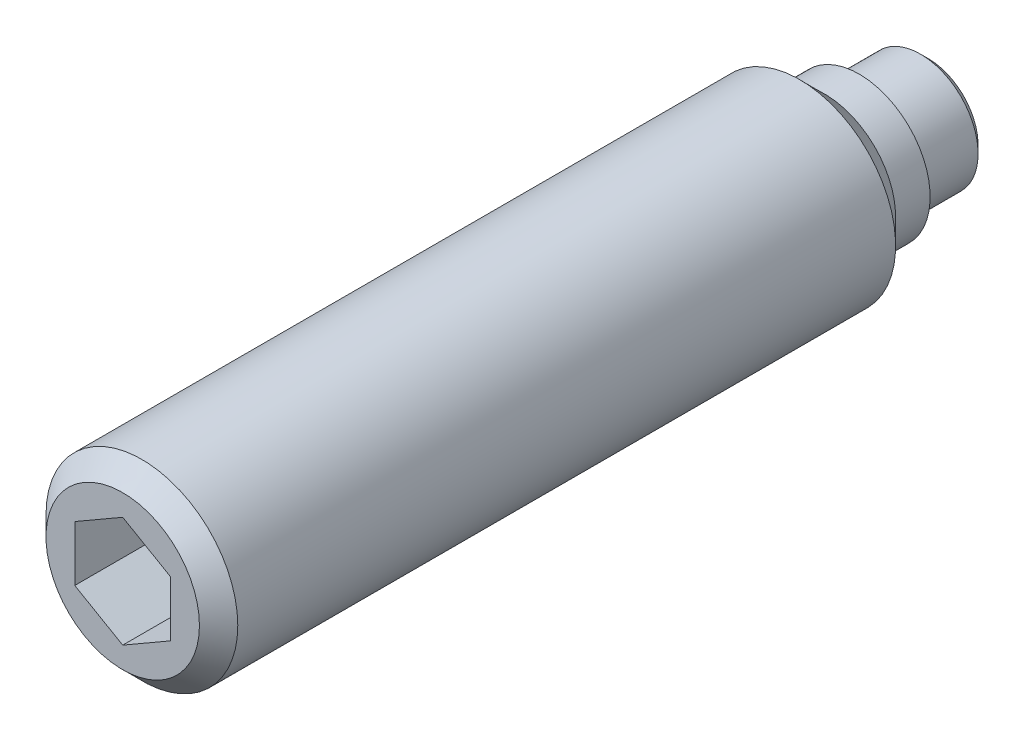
ISO-10303-21;
HEADER;
FILE_DESCRIPTION(('STEP AP214'),'2;1');
FILE_NAME('part.step','',(''),(''),'','','');
FILE_SCHEMA(('AUTOMOTIVE_DESIGN { 1 0 10303 214 1 1 1 1 }'));
ENDSEC;
DATA;
#1=APPLICATION_CONTEXT('core data for automotive mechanical design processes');
#2=APPLICATION_PROTOCOL_DEFINITION('international standard','automotive_design',2000,#1);
#3=PRODUCT_CONTEXT('',#1,'mechanical');
#4=PRODUCT('Part','Part','',(#3));
#5=PRODUCT_RELATED_PRODUCT_CATEGORY('part','',(#4));
#6=PRODUCT_DEFINITION_FORMATION('','',#4);
#7=PRODUCT_DEFINITION_CONTEXT('part definition',#1,'design');
#8=PRODUCT_DEFINITION('design','',#6,#7);
#9=PRODUCT_DEFINITION_SHAPE('','',#8);
#10=(LENGTH_UNIT() NAMED_UNIT(*) SI_UNIT(.MILLI.,.METRE.));
#11=(NAMED_UNIT(*) PLANE_ANGLE_UNIT() SI_UNIT($,.RADIAN.));
#12=(NAMED_UNIT(*) SI_UNIT($,.STERADIAN.) SOLID_ANGLE_UNIT());
#13=UNCERTAINTY_MEASURE_WITH_UNIT(LENGTH_MEASURE(1.E-05),#10,'distance_accuracy_value','');
#14=(GEOMETRIC_REPRESENTATION_CONTEXT(3) GLOBAL_UNCERTAINTY_ASSIGNED_CONTEXT((#13)) GLOBAL_UNIT_ASSIGNED_CONTEXT((#10,
#11,#12)) REPRESENTATION_CONTEXT('',''));
#15=CARTESIAN_POINT('',(0.,0.,0.));
#16=DIRECTION('',(0.,0.,1.));
#17=DIRECTION('',(1.,0.,0.));
#18=AXIS2_PLACEMENT_3D('',#15,#16,#17);
#19=CARTESIAN_POINT('',(0.,0.,1.8));
#20=DIRECTION('',(0.,0.,-1.));
#21=DIRECTION('',(-1.,0.,0.));
#22=AXIS2_PLACEMENT_3D('',#19,#20,#21);
#23=CYLINDRICAL_SURFACE('',#22,2.5);
#24=CARTESIAN_POINT('',(0.,0.,3.35));
#25=DIRECTION('',(0.,0.,-1.));
#26=DIRECTION('',(-1.,0.,0.));
#27=AXIS2_PLACEMENT_3D('',#24,#25,#26);
#28=CIRCLE('',#27,2.5);
#29=CARTESIAN_POINT('',(-2.5,0.,3.35));
#30=VERTEX_POINT('',#29);
#31=EDGE_CURVE('E9',#30,#30,#28,.T.);
#32=ORIENTED_EDGE('',*,*,#31,.F.);
#33=EDGE_LOOP('',(#32));
#34=FACE_BOUND('',#33,.T.);
#35=CARTESIAN_POINT('',(0.,0.,20.5));
#36=DIRECTION('',(0.,0.,1.));
#37=DIRECTION('',(1.,0.,0.));
#38=AXIS2_PLACEMENT_3D('',#35,#36,#37);
#39=CIRCLE('',#38,2.5);
#40=CARTESIAN_POINT('',(2.5,0.,20.5));
#41=VERTEX_POINT('',#40);
#42=EDGE_CURVE('E123',#41,#41,#39,.T.);
#43=ORIENTED_EDGE('',*,*,#42,.F.);
#44=EDGE_LOOP('',(#43));
#45=FACE_BOUND('',#44,.T.);
#46=ADVANCED_FACE('F14',(#34,#45),#23,.T.);
#47=CARTESIAN_POINT('',(0.,0.,3.35));
#48=DIRECTION('',(0.,0.,1.));
#49=DIRECTION('',(1.,0.,0.));
#50=AXIS2_PLACEMENT_3D('',#47,#48,#49);
#51=CONICAL_SURFACE('',#50,2.5,0.785398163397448);
#52=ORIENTED_EDGE('',*,*,#31,.T.);
#53=EDGE_LOOP('',(#52));
#54=FACE_BOUND('',#53,.T.);
#55=CARTESIAN_POINT('',(0.,0.,2.7));
#56=DIRECTION('',(0.,0.,-1.));
#57=DIRECTION('',(-1.,0.,0.));
#58=AXIS2_PLACEMENT_3D('',#55,#56,#57);
#59=CIRCLE('',#58,1.85);
#60=CARTESIAN_POINT('',(-1.85,0.,2.7));
#61=VERTEX_POINT('',#60);
#62=EDGE_CURVE('E21',#61,#61,#59,.T.);
#63=ORIENTED_EDGE('',*,*,#62,.F.);
#64=EDGE_LOOP('',(#63));
#65=FACE_BOUND('',#64,.T.);
#66=ADVANCED_FACE('F143',(#54,#65),#51,.T.);
#67=CARTESIAN_POINT('',(0.,0.,1.8));
#68=DIRECTION('',(0.,0.,-1.));
#69=DIRECTION('',(-1.,0.,0.));
#70=AXIS2_PLACEMENT_3D('',#67,#68,#69);
#71=CYLINDRICAL_SURFACE('',#70,1.85);
#72=ORIENTED_EDGE('',*,*,#62,.T.);
#73=EDGE_LOOP('',(#72));
#74=FACE_BOUND('',#73,.T.);
#75=CARTESIAN_POINT('',(0.,0.,1.8));
#76=DIRECTION('',(0.,0.,-1.));
#77=DIRECTION('',(-1.,0.,0.));
#78=AXIS2_PLACEMENT_3D('',#75,#76,#77);
#79=CIRCLE('',#78,1.85);
#80=CARTESIAN_POINT('',(-1.85,0.,1.8));
#81=VERTEX_POINT('',#80);
#82=EDGE_CURVE('E135',#81,#81,#79,.T.);
#83=ORIENTED_EDGE('',*,*,#82,.F.);
#84=EDGE_LOOP('',(#83));
#85=FACE_BOUND('',#84,.T.);
#86=ADVANCED_FACE('F140',(#74,#85),#71,.T.);
#87=CARTESIAN_POINT('',(0.,1.85,1.8));
#88=DIRECTION('',(0.,0.,1.));
#89=DIRECTION('',(1.,0.,0.));
#90=AXIS2_PLACEMENT_3D('',#87,#88,#89);
#91=PLANE('',#90);
#92=ORIENTED_EDGE('',*,*,#82,.T.);
#93=EDGE_LOOP('',(#92));
#94=FACE_BOUND('',#93,.T.);
#95=CARTESIAN_POINT('',(0.,0.,1.8));
#96=DIRECTION('',(0.,0.,-1.));
#97=DIRECTION('',(-1.,0.,0.));
#98=AXIS2_PLACEMENT_3D('',#95,#96,#97);
#99=CIRCLE('',#98,1.5);
#100=CARTESIAN_POINT('',(-1.5,0.,1.8));
#101=VERTEX_POINT('',#100);
#102=EDGE_CURVE('E132',#101,#101,#99,.T.);
#103=ORIENTED_EDGE('',*,*,#102,.F.);
#104=EDGE_LOOP('',(#103));
#105=FACE_BOUND('',#104,.T.);
#106=ADVANCED_FACE('F151',(#94,#105),#91,.F.);
#107=CARTESIAN_POINT('',(0.,0.,0.));
#108=DIRECTION('',(0.,0.,-1.));
#109=DIRECTION('',(-1.,0.,0.));
#110=AXIS2_PLACEMENT_3D('',#107,#108,#109);
#111=CYLINDRICAL_SURFACE('',#110,1.5);
#112=CARTESIAN_POINT('',(0.,0.,0.2));
#113=DIRECTION('',(0.,0.,-1.));
#114=DIRECTION('',(-1.,0.,0.));
#115=AXIS2_PLACEMENT_3D('',#112,#113,#114);
#116=CIRCLE('',#115,1.5);
#117=CARTESIAN_POINT('',(-1.5,0.,0.2));
#118=VERTEX_POINT('',#117);
#119=EDGE_CURVE('E129',#118,#118,#116,.T.);
#120=ORIENTED_EDGE('',*,*,#119,.F.);
#121=EDGE_LOOP('',(#120));
#122=FACE_BOUND('',#121,.T.);
#123=ORIENTED_EDGE('',*,*,#102,.T.);
#124=EDGE_LOOP('',(#123));
#125=FACE_BOUND('',#124,.T.);
#126=ADVANCED_FACE('F157',(#122,#125),#111,.T.);
#127=CARTESIAN_POINT('',(0.,0.,0.2));
#128=DIRECTION('',(0.,0.,1.));
#129=DIRECTION('',(1.,0.,0.));
#130=AXIS2_PLACEMENT_3D('',#127,#128,#129);
#131=CONICAL_SURFACE('',#130,1.5,0.785398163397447);
#132=CARTESIAN_POINT('',(0.,0.,0.));
#133=DIRECTION('',(0.,0.,-1.));
#134=DIRECTION('',(-1.,0.,0.));
#135=AXIS2_PLACEMENT_3D('',#132,#133,#134);
#136=CIRCLE('',#135,1.3);
#137=CARTESIAN_POINT('',(-1.3,0.,0.));
#138=VERTEX_POINT('',#137);
#139=EDGE_CURVE('E126',#138,#138,#136,.T.);
#140=ORIENTED_EDGE('',*,*,#139,.F.);
#141=EDGE_LOOP('',(#140));
#142=FACE_BOUND('',#141,.T.);
#143=ORIENTED_EDGE('',*,*,#119,.T.);
#144=EDGE_LOOP('',(#143));
#145=FACE_BOUND('',#144,.T.);
#146=ADVANCED_FACE('F161',(#142,#145),#131,.T.);
#147=CARTESIAN_POINT('',(0.,1.3,0.));
#148=DIRECTION('',(0.,0.,1.));
#149=DIRECTION('',(1.,0.,0.));
#150=AXIS2_PLACEMENT_3D('',#147,#148,#149);
#151=PLANE('',#150);
#152=ORIENTED_EDGE('',*,*,#139,.T.);
#153=EDGE_LOOP('',(#152));
#154=FACE_BOUND('',#153,.T.);
#155=ADVANCED_FACE('F165',(#154),#151,.F.);
#156=CARTESIAN_POINT('',(0.,0.,21.));
#157=DIRECTION('',(0.,0.,-1.));
#158=DIRECTION('',(-1.,0.,0.));
#159=AXIS2_PLACEMENT_3D('',#156,#157,#158);
#160=CONICAL_SURFACE('',#159,2.,0.785398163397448);
#161=ORIENTED_EDGE('',*,*,#42,.T.);
#162=EDGE_LOOP('',(#161));
#163=FACE_BOUND('',#162,.T.);
#164=CARTESIAN_POINT('',(0.,0.,21.));
#165=DIRECTION('',(0.,0.,1.));
#166=DIRECTION('',(1.,0.,0.));
#167=AXIS2_PLACEMENT_3D('',#164,#165,#166);
#168=CIRCLE('',#167,2.);
#169=CARTESIAN_POINT('',(2.,0.,21.));
#170=VERTEX_POINT('',#169);
#171=EDGE_CURVE('E115',#170,#170,#168,.T.);
#172=ORIENTED_EDGE('',*,*,#171,.F.);
#173=EDGE_LOOP('',(#172));
#174=FACE_BOUND('',#173,.T.);
#175=ADVANCED_FACE('F169',(#163,#174),#160,.T.);
#176=CARTESIAN_POINT('',(0.,-2.,21.));
#177=DIRECTION('',(0.,0.,1.));
#178=DIRECTION('',(1.,0.,0.));
#179=AXIS2_PLACEMENT_3D('',#176,#177,#178);
#180=PLANE('',#179);
#181=DIRECTION('',(0.866025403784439,-0.5,0.));
#182=VECTOR('',#181,1.);
#183=CARTESIAN_POINT('',(-1.25,-0.721687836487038,21.));
#184=LINE('',#183,#182);
#185=CARTESIAN_POINT('',(-1.25,-0.721687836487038,21.));
#186=VERTEX_POINT('',#185);
#187=CARTESIAN_POINT('',(0.,-1.44337567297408,21.));
#188=VERTEX_POINT('',#187);
#189=EDGE_CURVE('E28',#186,#188,#184,.T.);
#190=ORIENTED_EDGE('',*,*,#189,.F.);
#191=DIRECTION('',(0.,-1.,0.));
#192=VECTOR('',#191,1.);
#193=CARTESIAN_POINT('',(-1.25,0.721687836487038,21.));
#194=LINE('',#193,#192);
#195=CARTESIAN_POINT('',(-1.25,0.721687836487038,21.));
#196=VERTEX_POINT('',#195);
#197=EDGE_CURVE('E111',#196,#186,#194,.T.);
#198=ORIENTED_EDGE('',*,*,#197,.F.);
#199=DIRECTION('',(-0.866025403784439,-0.5,0.));
#200=VECTOR('',#199,1.);
#201=CARTESIAN_POINT('',(0.,1.44337567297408,21.));
#202=LINE('',#201,#200);
#203=CARTESIAN_POINT('',(0.,1.44337567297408,21.));
#204=VERTEX_POINT('',#203);
#205=EDGE_CURVE('E109',#204,#196,#202,.T.);
#206=ORIENTED_EDGE('',*,*,#205,.F.);
#207=DIRECTION('',(-0.866025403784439,0.5,0.));
#208=VECTOR('',#207,1.);
#209=CARTESIAN_POINT('',(1.25,0.721687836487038,21.));
#210=LINE('',#209,#208);
#211=CARTESIAN_POINT('',(1.25,0.721687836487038,21.));
#212=VERTEX_POINT('',#211);
#213=EDGE_CURVE('E76',#212,#204,#210,.T.);
#214=ORIENTED_EDGE('',*,*,#213,.F.);
#215=DIRECTION('',(0.,1.,0.));
#216=VECTOR('',#215,1.);
#217=CARTESIAN_POINT('',(1.25,-0.721687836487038,21.));
#218=LINE('',#217,#216);
#219=CARTESIAN_POINT('',(1.25,-0.721687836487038,21.));
#220=VERTEX_POINT('',#219);
#221=EDGE_CURVE('E105',#220,#212,#218,.T.);
#222=ORIENTED_EDGE('',*,*,#221,.F.);
#223=DIRECTION('',(0.866025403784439,0.5,0.));
#224=VECTOR('',#223,1.);
#225=CARTESIAN_POINT('',(0.,-1.44337567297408,21.));
#226=LINE('',#225,#224);
#227=EDGE_CURVE('E102',#188,#220,#226,.T.);
#228=ORIENTED_EDGE('',*,*,#227,.F.);
#229=EDGE_LOOP('',(#190,#198,#206,#214,#222,#228));
#230=FACE_BOUND('',#229,.T.);
#231=ORIENTED_EDGE('',*,*,#171,.T.);
#232=EDGE_LOOP('',(#231));
#233=FACE_BOUND('',#232,.T.);
#234=ADVANCED_FACE('F173',(#230,#233),#180,.T.);
#235=CARTESIAN_POINT('',(-1.25,-0.721687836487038,18.));
#236=DIRECTION('',(-0.5,-0.866025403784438,0.));
#237=DIRECTION('',(0.866025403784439,-0.5,0.));
#238=AXIS2_PLACEMENT_3D('',#235,#236,#237);
#239=PLANE('',#238);
#240=ORIENTED_EDGE('',*,*,#189,.T.);
#241=DIRECTION('',(0.,0.,1.));
#242=VECTOR('',#241,1.);
#243=CARTESIAN_POINT('',(0.,-1.44337567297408,18.));
#244=LINE('',#243,#242);
#245=CARTESIAN_POINT('',(0.,-1.44337567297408,18.));
#246=VERTEX_POINT('',#245);
#247=EDGE_CURVE('E58',#246,#188,#244,.T.);
#248=ORIENTED_EDGE('',*,*,#247,.F.);
#249=DIRECTION('',(0.866025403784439,-0.5,0.));
#250=VECTOR('',#249,1.);
#251=CARTESIAN_POINT('',(-1.25,-0.721687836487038,18.));
#252=LINE('',#251,#250);
#253=CARTESIAN_POINT('',(-1.25,-0.721687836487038,18.));
#254=VERTEX_POINT('',#253);
#255=EDGE_CURVE('E113',#254,#246,#252,.T.);
#256=ORIENTED_EDGE('',*,*,#255,.F.);
#257=DIRECTION('',(0.,0.,1.));
#258=VECTOR('',#257,1.);
#259=CARTESIAN_POINT('',(-1.25,-0.721687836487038,18.));
#260=LINE('',#259,#258);
#261=EDGE_CURVE('E36',#254,#186,#260,.T.);
#262=ORIENTED_EDGE('',*,*,#261,.T.);
#263=EDGE_LOOP('',(#240,#248,#256,#262));
#264=FACE_BOUND('',#263,.T.);
#265=ADVANCED_FACE('F177',(#264),#239,.F.);
#266=CARTESIAN_POINT('',(-1.25,0.721687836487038,18.));
#267=DIRECTION('',(-1.,0.,0.));
#268=DIRECTION('',(0.,0.,1.));
#269=AXIS2_PLACEMENT_3D('',#266,#267,#268);
#270=PLANE('',#269);
#271=ORIENTED_EDGE('',*,*,#197,.T.);
#272=ORIENTED_EDGE('',*,*,#261,.F.);
#273=DIRECTION('',(0.,-1.,0.));
#274=VECTOR('',#273,1.);
#275=CARTESIAN_POINT('',(-1.25,0.721687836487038,18.));
#276=LINE('',#275,#274);
#277=CARTESIAN_POINT('',(-1.25,0.721687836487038,18.));
#278=VERTEX_POINT('',#277);
#279=EDGE_CURVE('E88',#278,#254,#276,.T.);
#280=ORIENTED_EDGE('',*,*,#279,.F.);
#281=DIRECTION('',(0.,0.,1.));
#282=VECTOR('',#281,1.);
#283=CARTESIAN_POINT('',(-1.25,0.721687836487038,18.));
#284=LINE('',#283,#282);
#285=EDGE_CURVE('E80',#278,#196,#284,.T.);
#286=ORIENTED_EDGE('',*,*,#285,.T.);
#287=EDGE_LOOP('',(#271,#272,#280,#286));
#288=FACE_BOUND('',#287,.T.);
#289=ADVANCED_FACE('F181',(#288),#270,.F.);
#290=CARTESIAN_POINT('',(0.,1.44337567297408,18.));
#291=DIRECTION('',(-0.5,0.866025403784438,0.));
#292=DIRECTION('',(-0.866025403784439,-0.5,0.));
#293=AXIS2_PLACEMENT_3D('',#290,#291,#292);
#294=PLANE('',#293);
#295=ORIENTED_EDGE('',*,*,#205,.T.);
#296=ORIENTED_EDGE('',*,*,#285,.F.);
#297=DIRECTION('',(-0.866025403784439,-0.5,0.));
#298=VECTOR('',#297,1.);
#299=CARTESIAN_POINT('',(0.,1.44337567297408,18.));
#300=LINE('',#299,#298);
#301=CARTESIAN_POINT('',(0.,1.44337567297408,18.));
#302=VERTEX_POINT('',#301);
#303=EDGE_CURVE('E84',#302,#278,#300,.T.);
#304=ORIENTED_EDGE('',*,*,#303,.F.);
#305=DIRECTION('',(0.,0.,1.));
#306=VECTOR('',#305,1.);
#307=CARTESIAN_POINT('',(0.,1.44337567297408,18.));
#308=LINE('',#307,#306);
#309=EDGE_CURVE('E69',#302,#204,#308,.T.);
#310=ORIENTED_EDGE('',*,*,#309,.T.);
#311=EDGE_LOOP('',(#295,#296,#304,#310));
#312=FACE_BOUND('',#311,.T.);
#313=ADVANCED_FACE('F85',(#312),#294,.F.);
#314=CARTESIAN_POINT('',(1.25,0.721687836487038,18.));
#315=DIRECTION('',(0.5,0.866025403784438,0.));
#316=DIRECTION('',(-0.866025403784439,0.5,0.));
#317=AXIS2_PLACEMENT_3D('',#314,#315,#316);
#318=PLANE('',#317);
#319=ORIENTED_EDGE('',*,*,#213,.T.);
#320=ORIENTED_EDGE('',*,*,#309,.F.);
#321=DIRECTION('',(-0.866025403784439,0.5,0.));
#322=VECTOR('',#321,1.);
#323=CARTESIAN_POINT('',(1.25,0.721687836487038,18.));
#324=LINE('',#323,#322);
#325=CARTESIAN_POINT('',(1.25,0.721687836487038,18.));
#326=VERTEX_POINT('',#325);
#327=EDGE_CURVE('E73',#326,#302,#324,.T.);
#328=ORIENTED_EDGE('',*,*,#327,.F.);
#329=DIRECTION('',(0.,0.,1.));
#330=VECTOR('',#329,1.);
#331=CARTESIAN_POINT('',(1.25,0.721687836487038,18.));
#332=LINE('',#331,#330);
#333=EDGE_CURVE('E81',#326,#212,#332,.T.);
#334=ORIENTED_EDGE('',*,*,#333,.T.);
#335=EDGE_LOOP('',(#319,#320,#328,#334));
#336=FACE_BOUND('',#335,.T.);
#337=ADVANCED_FACE('F71',(#336),#318,.F.);
#338=CARTESIAN_POINT('',(1.25,-0.721687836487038,18.));
#339=DIRECTION('',(1.,0.,0.));
#340=DIRECTION('',(0.,0.,-1.));
#341=AXIS2_PLACEMENT_3D('',#338,#339,#340);
#342=PLANE('',#341);
#343=ORIENTED_EDGE('',*,*,#221,.T.);
#344=ORIENTED_EDGE('',*,*,#333,.F.);
#345=DIRECTION('',(0.,1.,0.));
#346=VECTOR('',#345,1.);
#347=CARTESIAN_POINT('',(1.25,-0.721687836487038,18.));
#348=LINE('',#347,#346);
#349=CARTESIAN_POINT('',(1.25,-0.721687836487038,18.));
#350=VERTEX_POINT('',#349);
#351=EDGE_CURVE('E94',#350,#326,#348,.T.);
#352=ORIENTED_EDGE('',*,*,#351,.F.);
#353=DIRECTION('',(0.,0.,1.));
#354=VECTOR('',#353,1.);
#355=CARTESIAN_POINT('',(1.25,-0.721687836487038,18.));
#356=LINE('',#355,#354);
#357=EDGE_CURVE('E118',#350,#220,#356,.T.);
#358=ORIENTED_EDGE('',*,*,#357,.T.);
#359=EDGE_LOOP('',(#343,#344,#352,#358));
#360=FACE_BOUND('',#359,.T.);
#361=ADVANCED_FACE('F185',(#360),#342,.F.);
#362=CARTESIAN_POINT('',(0.,-1.44337567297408,18.));
#363=DIRECTION('',(0.5,-0.866025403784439,0.));
#364=DIRECTION('',(0.866025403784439,0.5,0.));
#365=AXIS2_PLACEMENT_3D('',#362,#363,#364);
#366=PLANE('',#365);
#367=ORIENTED_EDGE('',*,*,#227,.T.);
#368=ORIENTED_EDGE('',*,*,#357,.F.);
#369=DIRECTION('',(0.866025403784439,0.5,0.));
#370=VECTOR('',#369,1.);
#371=CARTESIAN_POINT('',(0.,-1.44337567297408,18.));
#372=LINE('',#371,#370);
#373=EDGE_CURVE('E96',#246,#350,#372,.T.);
#374=ORIENTED_EDGE('',*,*,#373,.F.);
#375=ORIENTED_EDGE('',*,*,#247,.T.);
#376=EDGE_LOOP('',(#367,#368,#374,#375));
#377=FACE_BOUND('',#376,.T.);
#378=ADVANCED_FACE('F182',(#377),#366,.F.);
#379=CARTESIAN_POINT('',(0.,0.,18.));
#380=DIRECTION('',(0.,0.,1.));
#381=DIRECTION('',(1.,0.,0.));
#382=AXIS2_PLACEMENT_3D('',#379,#380,#381);
#383=PLANE('',#382);
#384=ORIENTED_EDGE('',*,*,#255,.T.);
#385=ORIENTED_EDGE('',*,*,#373,.T.);
#386=ORIENTED_EDGE('',*,*,#351,.T.);
#387=ORIENTED_EDGE('',*,*,#327,.T.);
#388=ORIENTED_EDGE('',*,*,#303,.T.);
#389=ORIENTED_EDGE('',*,*,#279,.T.);
#390=EDGE_LOOP('',(#384,#385,#386,#387,#388,#389));
#391=FACE_BOUND('',#390,.T.);
#392=ADVANCED_FACE('F91',(#391),#383,.T.);
#393=CLOSED_SHELL('',(#46,#66,#86,#106,#126,#146,#155,#175,#234,#265,#289,#313,#337,#361,#378,#392));
#394=MANIFOLD_SOLID_BREP('B1',#393);
#395=ADVANCED_BREP_SHAPE_REPRESENTATION('',(#18,#394),#14);
#396=SHAPE_DEFINITION_REPRESENTATION(#9,#395);
ENDSEC;
END-ISO-10303-21;
